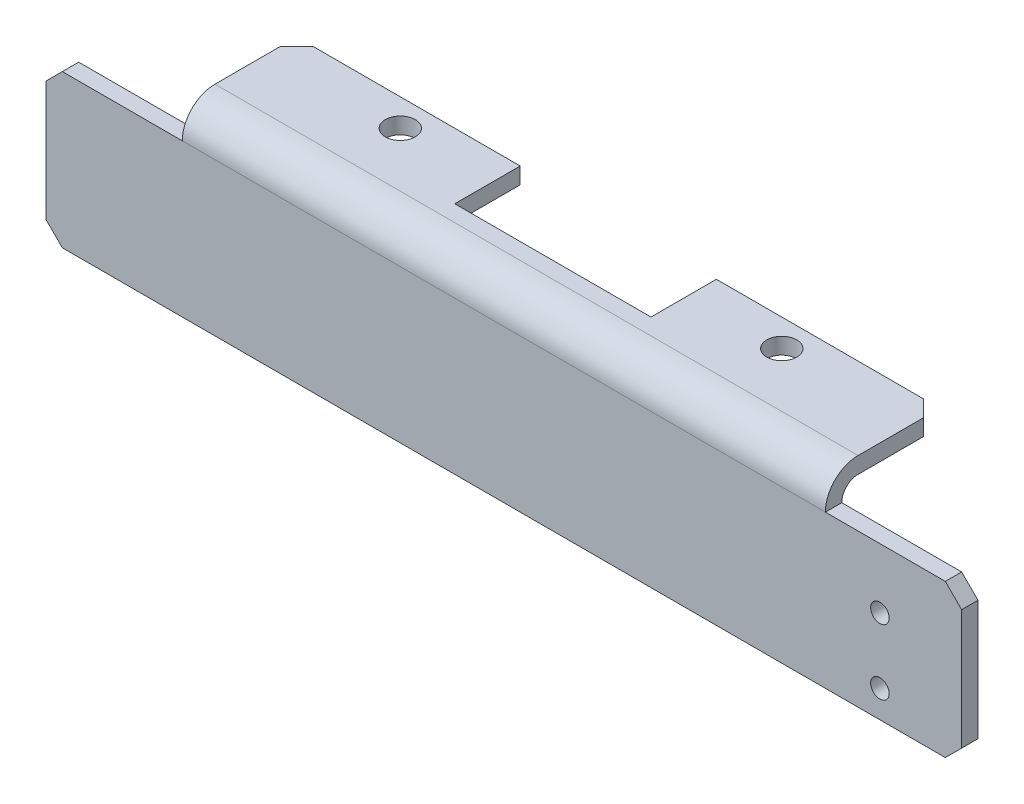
ISO-10303-21;
HEADER;
FILE_DESCRIPTION(('STEP AP214'),'2;1');
FILE_NAME('part.step','',(''),(''),'','','');
FILE_SCHEMA(('AUTOMOTIVE_DESIGN { 1 0 10303 214 1 1 1 1 }'));
ENDSEC;
DATA;
#1=APPLICATION_CONTEXT('core data for automotive mechanical design processes');
#2=APPLICATION_PROTOCOL_DEFINITION('international standard','automotive_design',2000,#1);
#3=PRODUCT_CONTEXT('',#1,'mechanical');
#4=PRODUCT('Part','Part','',(#3));
#5=PRODUCT_RELATED_PRODUCT_CATEGORY('part','',(#4));
#6=PRODUCT_DEFINITION_FORMATION('','',#4);
#7=PRODUCT_DEFINITION_CONTEXT('part definition',#1,'design');
#8=PRODUCT_DEFINITION('design','',#6,#7);
#9=PRODUCT_DEFINITION_SHAPE('','',#8);
#10=(LENGTH_UNIT() NAMED_UNIT(*) SI_UNIT(.MILLI.,.METRE.));
#11=(NAMED_UNIT(*) PLANE_ANGLE_UNIT() SI_UNIT($,.RADIAN.));
#12=(NAMED_UNIT(*) SI_UNIT($,.STERADIAN.) SOLID_ANGLE_UNIT());
#13=UNCERTAINTY_MEASURE_WITH_UNIT(LENGTH_MEASURE(1.E-05),#10,'distance_accuracy_value','');
#14=(GEOMETRIC_REPRESENTATION_CONTEXT(3) GLOBAL_UNCERTAINTY_ASSIGNED_CONTEXT((#13)) GLOBAL_UNIT_ASSIGNED_CONTEXT((#10,
#11,#12)) REPRESENTATION_CONTEXT('',''));
#15=CARTESIAN_POINT('',(0.,0.,0.));
#16=DIRECTION('',(0.,0.,1.));
#17=DIRECTION('',(1.,0.,0.));
#18=AXIS2_PLACEMENT_3D('',#15,#16,#17);
#19=CARTESIAN_POINT('',(168.,4.98148640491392,-17.6273582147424));
#20=DIRECTION('',(0.,0.,1.));
#21=DIRECTION('',(1.,0.,0.));
#22=AXIS2_PLACEMENT_3D('',#19,#20,#21);
#23=PLANE('',#22);
#24=DIRECTION('',(-1.,0.,0.));
#25=VECTOR('',#24,1.);
#26=CARTESIAN_POINT('',(168.,4.98148640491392,-17.6273582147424));
#27=LINE('',#26,#25);
#28=CARTESIAN_POINT('',(65.9999999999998,4.98148640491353,-17.6273582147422));
#29=VERTEX_POINT('',#28);
#30=CARTESIAN_POINT('',(28.,4.9814864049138,-17.6273582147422));
#31=VERTEX_POINT('',#30);
#32=EDGE_CURVE('E260',#29,#31,#27,.T.);
#33=ORIENTED_EDGE('',*,*,#32,.T.);
#34=DIRECTION('',(0.,1.,0.));
#35=VECTOR('',#34,1.);
#36=CARTESIAN_POINT('',(27.9999999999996,4.98148640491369,-17.6273582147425));
#37=LINE('',#36,#35);
#38=CARTESIAN_POINT('',(27.9999999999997,7.9814864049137,-17.627358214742));
#39=VERTEX_POINT('',#38);
#40=EDGE_CURVE('E314',#31,#39,#37,.T.);
#41=ORIENTED_EDGE('',*,*,#40,.T.);
#42=DIRECTION('',(-1.,0.,0.));
#43=VECTOR('',#42,1.);
#44=CARTESIAN_POINT('',(168.,7.98148640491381,-17.627358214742));
#45=LINE('',#44,#43);
#46=CARTESIAN_POINT('',(66.,7.9814864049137,-17.627358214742));
#47=VERTEX_POINT('',#46);
#48=EDGE_CURVE('E258',#47,#39,#45,.T.);
#49=ORIENTED_EDGE('',*,*,#48,.F.);
#50=DIRECTION('',(0.,1.,0.));
#51=VECTOR('',#50,1.);
#52=CARTESIAN_POINT('',(65.9999999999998,1.98148640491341,-17.6273582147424));
#53=LINE('',#52,#51);
#54=EDGE_CURVE('E202',#29,#47,#53,.T.);
#55=ORIENTED_EDGE('',*,*,#54,.F.);
#56=EDGE_LOOP('',(#33,#41,#49,#55));
#57=FACE_BOUND('',#56,.T.);
#58=ADVANCED_FACE('F36',(#57),#23,.F.);
#59=CARTESIAN_POINT('',(168.,-26.0185135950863,0.372641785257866));
#60=DIRECTION('',(0.,1.,0.));
#61=DIRECTION('',(0.,0.,1.));
#62=AXIS2_PLACEMENT_3D('',#59,#60,#61);
#63=PLANE('',#62);
#64=DIRECTION('',(-1.,0.,0.));
#65=VECTOR('',#64,1.);
#66=CARTESIAN_POINT('',(168.,-26.0185135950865,3.37264178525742));
#67=LINE('',#66,#65);
#68=CARTESIAN_POINT('',(165.,-26.0185135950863,3.3726417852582));
#69=VERTEX_POINT('',#68);
#70=CARTESIAN_POINT('',(3.0000000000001,-26.0185135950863,3.37264178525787));
#71=VERTEX_POINT('',#70);
#72=EDGE_CURVE('E245',#69,#71,#67,.T.);
#73=ORIENTED_EDGE('',*,*,#72,.T.);
#74=DIRECTION('',(0.,0.,-1.));
#75=VECTOR('',#74,1.);
#76=CARTESIAN_POINT('',(2.99999999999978,-26.0185135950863,0.372641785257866));
#77=LINE('',#76,#75);
#78=CARTESIAN_POINT('',(2.99999999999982,-26.0185135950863,0.372641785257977));
#79=VERTEX_POINT('',#78);
#80=EDGE_CURVE('E280',#71,#79,#77,.T.);
#81=ORIENTED_EDGE('',*,*,#80,.T.);
#82=DIRECTION('',(-1.,0.,0.));
#83=VECTOR('',#82,1.);
#84=CARTESIAN_POINT('',(168.,-26.0185135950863,0.372641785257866));
#85=LINE('',#84,#83);
#86=CARTESIAN_POINT('',(165.,-26.0185135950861,0.372641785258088));
#87=VERTEX_POINT('',#86);
#88=EDGE_CURVE('E269',#87,#79,#85,.T.);
#89=ORIENTED_EDGE('',*,*,#88,.F.);
#90=DIRECTION('',(0.,0.,1.));
#91=VECTOR('',#90,1.);
#92=CARTESIAN_POINT('',(165.,-26.0185135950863,3.3726417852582));
#93=LINE('',#92,#91);
#94=EDGE_CURVE('E278',#87,#69,#93,.T.);
#95=ORIENTED_EDGE('',*,*,#94,.T.);
#96=EDGE_LOOP('',(#73,#81,#89,#95));
#97=FACE_BOUND('',#96,.T.);
#98=ADVANCED_FACE('F417',(#97),#63,.F.);
#99=CARTESIAN_POINT('',(168.,1.9814864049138,0.372641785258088));
#100=DIRECTION('',(0.,0.,1.));
#101=DIRECTION('',(0.,-1.,0.));
#102=AXIS2_PLACEMENT_3D('',#99,#100,#101);
#103=PLANE('',#102);
#104=CARTESIAN_POINT('',(153.,-21.0185135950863,0.372641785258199));
#105=DIRECTION('',(0.,0.,1.));
#106=DIRECTION('',(0.,-1.,0.));
#107=AXIS2_PLACEMENT_3D('',#104,#105,#106);
#108=CIRCLE('',#107,1.70000000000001);
#109=CARTESIAN_POINT('',(153.,-22.7185135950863,0.372641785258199));
#110=VERTEX_POINT('',#109);
#111=EDGE_CURVE('E379',#110,#110,#108,.T.);
#112=ORIENTED_EDGE('',*,*,#111,.T.);
#113=EDGE_LOOP('',(#112));
#114=FACE_BOUND('',#113,.T.);
#115=CARTESIAN_POINT('',(153.,-9.01851359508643,0.372641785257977));
#116=DIRECTION('',(0.,0.,1.));
#117=DIRECTION('',(0.,-1.,0.));
#118=AXIS2_PLACEMENT_3D('',#115,#116,#117);
#119=CIRCLE('',#118,1.70000000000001);
#120=CARTESIAN_POINT('',(153.,-10.7185135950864,0.372641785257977));
#121=VERTEX_POINT('',#120);
#122=EDGE_CURVE('E384',#121,#121,#119,.T.);
#123=ORIENTED_EDGE('',*,*,#122,.T.);
#124=EDGE_LOOP('',(#123));
#125=FACE_BOUND('',#124,.T.);
#126=ORIENTED_EDGE('',*,*,#88,.T.);
#127=DIRECTION('',(0.707106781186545,-0.707106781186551,0.));
#128=VECTOR('',#127,1.);
#129=CARTESIAN_POINT('',(2.99999999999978,-26.0185135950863,0.372641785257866));
#130=LINE('',#129,#128);
#131=CARTESIAN_POINT('',(-1.11022302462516E-13,-23.0185135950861,0.372641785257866));
#132=VERTEX_POINT('',#131);
#133=EDGE_CURVE('E289',#79,#132,#130,.F.);
#134=ORIENTED_EDGE('',*,*,#133,.T.);
#135=DIRECTION('',(0.,1.,0.));
#136=VECTOR('',#135,1.);
#137=CARTESIAN_POINT('',(-4.44089209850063E-13,1.98148640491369,0.372641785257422));
#138=LINE('',#137,#136);
#139=CARTESIAN_POINT('',(0.,-1.01851359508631,0.372641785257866));
#140=VERTEX_POINT('',#139);
#141=EDGE_CURVE('E237',#132,#140,#138,.T.);
#142=ORIENTED_EDGE('',*,*,#141,.T.);
#143=DIRECTION('',(-0.707106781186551,-0.707106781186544,0.));
#144=VECTOR('',#143,1.);
#145=CARTESIAN_POINT('',(0.,-1.01851359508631,0.372641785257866));
#146=LINE('',#145,#144);
#147=CARTESIAN_POINT('',(2.99999999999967,1.98148640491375,0.372641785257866));
#148=VERTEX_POINT('',#147);
#149=EDGE_CURVE('E287',#140,#148,#146,.F.);
#150=ORIENTED_EDGE('',*,*,#149,.T.);
#151=DIRECTION('',(-1.,0.,0.));
#152=VECTOR('',#151,1.);
#153=CARTESIAN_POINT('',(168.,1.98148640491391,0.372641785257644));
#154=LINE('',#153,#152);
#155=CARTESIAN_POINT('',(25.,1.9814864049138,0.372641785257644));
#156=VERTEX_POINT('',#155);
#157=EDGE_CURVE('E215',#148,#156,#154,.F.);
#158=ORIENTED_EDGE('',*,*,#157,.T.);
#159=DIRECTION('',(-1.,0.,0.));
#160=VECTOR('',#159,1.);
#161=CARTESIAN_POINT('',(168.,1.9814864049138,0.372641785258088));
#162=LINE('',#161,#160);
#163=CARTESIAN_POINT('',(143.,1.98148640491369,0.372641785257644));
#164=VERTEX_POINT('',#163);
#165=EDGE_CURVE('E266',#164,#156,#162,.T.);
#166=ORIENTED_EDGE('',*,*,#165,.F.);
#167=CARTESIAN_POINT('',(165.,1.98148640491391,0.372641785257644));
#168=VERTEX_POINT('',#167);
#169=EDGE_CURVE('E267',#168,#164,#162,.T.);
#170=ORIENTED_EDGE('',*,*,#169,.F.);
#171=DIRECTION('',(0.707106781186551,-0.707106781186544,0.));
#172=VECTOR('',#171,1.);
#173=CARTESIAN_POINT('',(165.,1.98148640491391,0.372641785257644));
#174=LINE('',#173,#172);
#175=CARTESIAN_POINT('',(168.,-1.01851359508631,0.372641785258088));
#176=VERTEX_POINT('',#175);
#177=EDGE_CURVE('E285',#168,#176,#174,.T.);
#178=ORIENTED_EDGE('',*,*,#177,.T.);
#179=DIRECTION('',(0.,1.,0.));
#180=VECTOR('',#179,1.);
#181=CARTESIAN_POINT('',(168.,1.9814864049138,0.372641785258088));
#182=LINE('',#181,#180);
#183=CARTESIAN_POINT('',(168.,-23.0185135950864,0.372641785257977));
#184=VERTEX_POINT('',#183);
#185=EDGE_CURVE('E238',#184,#176,#182,.T.);
#186=ORIENTED_EDGE('',*,*,#185,.F.);
#187=DIRECTION('',(-0.707106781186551,-0.707106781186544,0.));
#188=VECTOR('',#187,1.);
#189=CARTESIAN_POINT('',(168.,-23.0185135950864,0.372641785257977));
#190=LINE('',#189,#188);
#191=EDGE_CURVE('E283',#184,#87,#190,.T.);
#192=ORIENTED_EDGE('',*,*,#191,.T.);
#193=EDGE_LOOP('',(#126,#134,#142,#150,#158,#166,#170,#178,#186,#192));
#194=FACE_BOUND('',#193,.T.);
#195=ADVANCED_FACE('F347',(#114,#125,#194),#103,.F.);
#196=CARTESIAN_POINT('',(168.,1.98148640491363,-2.62735821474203));
#197=DIRECTION('',(-1.,0.,0.));
#198=DIRECTION('',(0.,0.,1.));
#199=AXIS2_PLACEMENT_3D('',#196,#197,#198);
#200=CYLINDRICAL_SURFACE('',#199,3.);
#201=DIRECTION('',(-1.,0.,0.));
#202=VECTOR('',#201,1.);
#203=CARTESIAN_POINT('',(168.,4.98148640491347,-2.62735821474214));
#204=LINE('',#203,#202);
#205=CARTESIAN_POINT('',(143.,4.98148640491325,-2.62735821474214));
#206=VERTEX_POINT('',#205);
#207=CARTESIAN_POINT('',(25.,4.98148640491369,-2.62735821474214));
#208=VERTEX_POINT('',#207);
#209=EDGE_CURVE('E263',#206,#208,#204,.T.);
#210=ORIENTED_EDGE('',*,*,#209,.F.);
#211=CARTESIAN_POINT('',(143.,1.9814864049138,-2.62735821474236));
#212=DIRECTION('',(-1.,0.,0.));
#213=DIRECTION('',(0.,0.,1.));
#214=AXIS2_PLACEMENT_3D('',#211,#212,#213);
#215=CIRCLE('',#214,3.);
#216=EDGE_CURVE('E234',#206,#164,#215,.F.);
#217=ORIENTED_EDGE('',*,*,#216,.T.);
#218=ORIENTED_EDGE('',*,*,#165,.T.);
#219=CARTESIAN_POINT('',(24.9999999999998,1.98148640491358,-2.62735821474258));
#220=DIRECTION('',(1.,0.,0.));
#221=DIRECTION('',(0.,0.,-1.));
#222=AXIS2_PLACEMENT_3D('',#219,#220,#221);
#223=CIRCLE('',#222,3.);
#224=EDGE_CURVE('E229',#156,#208,#223,.F.);
#225=ORIENTED_EDGE('',*,*,#224,.T.);
#226=EDGE_LOOP('',(#210,#217,#218,#225));
#227=FACE_BOUND('',#226,.T.);
#228=ADVANCED_FACE('F354',(#227),#200,.F.);
#229=CARTESIAN_POINT('',(168.,4.98148640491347,-2.62735821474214));
#230=DIRECTION('',(0.,1.,0.));
#231=DIRECTION('',(0.,0.,1.));
#232=AXIS2_PLACEMENT_3D('',#229,#230,#231);
#233=PLANE('',#232);
#234=CARTESIAN_POINT('',(48.9999999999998,4.9814864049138,-12.6273582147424));
#235=DIRECTION('',(0.,1.,0.));
#236=DIRECTION('',(0.,0.,1.));
#237=AXIS2_PLACEMENT_3D('',#234,#235,#236);
#238=CIRCLE('',#237,2.75);
#239=CARTESIAN_POINT('',(48.9999999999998,4.9814864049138,-9.87735821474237));
#240=VERTEX_POINT('',#239);
#241=EDGE_CURVE('E368',#240,#240,#238,.T.);
#242=ORIENTED_EDGE('',*,*,#241,.T.);
#243=EDGE_LOOP('',(#242));
#244=FACE_BOUND('',#243,.T.);
#245=CARTESIAN_POINT('',(119.,4.98148640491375,-12.6273582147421));
#246=DIRECTION('',(0.,1.,0.));
#247=DIRECTION('',(0.,0.,1.));
#248=AXIS2_PLACEMENT_3D('',#245,#246,#247);
#249=CIRCLE('',#248,2.75000000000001);
#250=CARTESIAN_POINT('',(119.,4.98148640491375,-9.87735821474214));
#251=VERTEX_POINT('',#250);
#252=EDGE_CURVE('E370',#251,#251,#249,.T.);
#253=ORIENTED_EDGE('',*,*,#252,.T.);
#254=EDGE_LOOP('',(#253));
#255=FACE_BOUND('',#254,.T.);
#256=DIRECTION('',(0.,0.,-1.));
#257=VECTOR('',#256,1.);
#258=CARTESIAN_POINT('',(25.,4.98148640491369,-2.62735821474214));
#259=LINE('',#258,#257);
#260=CARTESIAN_POINT('',(24.9999999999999,4.98148640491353,-14.6273582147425));
#261=VERTEX_POINT('',#260);
#262=EDGE_CURVE('E226',#208,#261,#259,.T.);
#263=ORIENTED_EDGE('',*,*,#262,.T.);
#264=DIRECTION('',(-0.707106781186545,0.,0.707106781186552));
#265=VECTOR('',#264,1.);
#266=CARTESIAN_POINT('',(27.9999999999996,4.98148640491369,-17.6273582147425));
#267=LINE('',#266,#265);
#268=EDGE_CURVE('E324',#261,#31,#267,.F.);
#269=ORIENTED_EDGE('',*,*,#268,.T.);
#270=ORIENTED_EDGE('',*,*,#32,.F.);
#271=DIRECTION('',(0.,0.,1.));
#272=VECTOR('',#271,1.);
#273=CARTESIAN_POINT('',(65.9999999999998,4.98148640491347,-2.62735821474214));
#274=LINE('',#273,#272);
#275=CARTESIAN_POINT('',(65.9999999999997,4.98148640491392,-5.62735821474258));
#276=VERTEX_POINT('',#275);
#277=EDGE_CURVE('E208',#29,#276,#274,.T.);
#278=ORIENTED_EDGE('',*,*,#277,.T.);
#279=DIRECTION('',(1.,0.,0.));
#280=VECTOR('',#279,1.);
#281=CARTESIAN_POINT('',(168.,4.98148640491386,-5.62735821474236));
#282=LINE('',#281,#280);
#283=CARTESIAN_POINT('',(102.,4.98148640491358,-5.62735821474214));
#284=VERTEX_POINT('',#283);
#285=EDGE_CURVE('E204',#276,#284,#282,.T.);
#286=ORIENTED_EDGE('',*,*,#285,.T.);
#287=DIRECTION('',(0.,0.,-1.));
#288=VECTOR('',#287,1.);
#289=CARTESIAN_POINT('',(102.,4.98148640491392,-2.62735821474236));
#290=LINE('',#289,#288);
#291=CARTESIAN_POINT('',(102.,4.98148640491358,-17.6273582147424));
#292=VERTEX_POINT('',#291);
#293=EDGE_CURVE('E180',#284,#292,#290,.T.);
#294=ORIENTED_EDGE('',*,*,#293,.T.);
#295=CARTESIAN_POINT('',(140.,4.9814864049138,-17.6273582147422));
#296=VERTEX_POINT('',#295);
#297=EDGE_CURVE('E261',#296,#292,#27,.T.);
#298=ORIENTED_EDGE('',*,*,#297,.F.);
#299=DIRECTION('',(-0.707106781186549,0.,-0.707106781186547));
#300=VECTOR('',#299,1.);
#301=CARTESIAN_POINT('',(143.,4.9814864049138,-14.6273582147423));
#302=LINE('',#301,#300);
#303=CARTESIAN_POINT('',(143.,4.9814864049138,-14.6273582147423));
#304=VERTEX_POINT('',#303);
#305=EDGE_CURVE('E51',#296,#304,#302,.F.);
#306=ORIENTED_EDGE('',*,*,#305,.T.);
#307=DIRECTION('',(0.,0.,1.));
#308=VECTOR('',#307,1.);
#309=CARTESIAN_POINT('',(143.,4.98148640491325,-2.62735821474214));
#310=LINE('',#309,#308);
#311=EDGE_CURVE('E232',#304,#206,#310,.T.);
#312=ORIENTED_EDGE('',*,*,#311,.T.);
#313=ORIENTED_EDGE('',*,*,#209,.T.);
#314=EDGE_LOOP('',(#263,#269,#270,#278,#286,#294,#298,#306,#312,#313));
#315=FACE_BOUND('',#314,.T.);
#316=ADVANCED_FACE('F355',(#244,#255,#315),#233,.F.);
#317=CARTESIAN_POINT('',(140.,7.98148640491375,-17.627358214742));
#318=VERTEX_POINT('',#317);
#319=CARTESIAN_POINT('',(102.,7.98148640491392,-17.6273582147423));
#320=VERTEX_POINT('',#319);
#321=EDGE_CURVE('E197',#318,#320,#45,.T.);
#322=ORIENTED_EDGE('',*,*,#321,.F.);
#323=DIRECTION('',(0.,-1.,0.));
#324=VECTOR('',#323,1.);
#325=CARTESIAN_POINT('',(140.,4.9814864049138,-17.6273582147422));
#326=LINE('',#325,#324);
#327=EDGE_CURVE('E11',#318,#296,#326,.T.);
#328=ORIENTED_EDGE('',*,*,#327,.T.);
#329=ORIENTED_EDGE('',*,*,#297,.T.);
#330=DIRECTION('',(0.,1.,0.));
#331=VECTOR('',#330,1.);
#332=CARTESIAN_POINT('',(102.,1.98148640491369,-17.6273582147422));
#333=LINE('',#332,#331);
#334=EDGE_CURVE('E183',#292,#320,#333,.T.);
#335=ORIENTED_EDGE('',*,*,#334,.T.);
#336=EDGE_LOOP('',(#322,#328,#329,#335));
#337=FACE_BOUND('',#336,.T.);
#338=ADVANCED_FACE('F442',(#337),#23,.F.);
#339=CARTESIAN_POINT('',(168.,7.9814864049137,-2.62735821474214));
#340=DIRECTION('',(0.,-1.,0.));
#341=DIRECTION('',(0.,0.,-1.));
#342=AXIS2_PLACEMENT_3D('',#339,#340,#341);
#343=PLANE('',#342);
#344=CARTESIAN_POINT('',(49.,7.9814864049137,-12.6273582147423));
#345=DIRECTION('',(0.,1.,0.));
#346=DIRECTION('',(0.,0.,1.));
#347=AXIS2_PLACEMENT_3D('',#344,#345,#346);
#348=CIRCLE('',#347,2.75);
#349=CARTESIAN_POINT('',(49.,7.9814864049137,-9.87735821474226));
#350=VERTEX_POINT('',#349);
#351=EDGE_CURVE('E375',#350,#350,#348,.T.);
#352=ORIENTED_EDGE('',*,*,#351,.F.);
#353=EDGE_LOOP('',(#352));
#354=FACE_BOUND('',#353,.T.);
#355=CARTESIAN_POINT('',(119.,7.98148640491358,-12.6273582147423));
#356=DIRECTION('',(0.,1.,0.));
#357=DIRECTION('',(0.,0.,1.));
#358=AXIS2_PLACEMENT_3D('',#355,#356,#357);
#359=CIRCLE('',#358,2.75000000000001);
#360=CARTESIAN_POINT('',(119.,7.98148640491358,-9.87735821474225));
#361=VERTEX_POINT('',#360);
#362=EDGE_CURVE('E376',#361,#361,#359,.T.);
#363=ORIENTED_EDGE('',*,*,#362,.F.);
#364=EDGE_LOOP('',(#363));
#365=FACE_BOUND('',#364,.T.);
#366=ORIENTED_EDGE('',*,*,#48,.T.);
#367=DIRECTION('',(0.707106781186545,0.,-0.707106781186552));
#368=VECTOR('',#367,1.);
#369=CARTESIAN_POINT('',(27.9999999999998,7.98148640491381,-17.6273582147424));
#370=LINE('',#369,#368);
#371=CARTESIAN_POINT('',(25.,7.98148640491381,-14.6273582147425));
#372=VERTEX_POINT('',#371);
#373=EDGE_CURVE('E319',#39,#372,#370,.F.);
#374=ORIENTED_EDGE('',*,*,#373,.T.);
#375=DIRECTION('',(0.,0.,-1.));
#376=VECTOR('',#375,1.);
#377=CARTESIAN_POINT('',(24.9999999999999,7.9814864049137,-17.6273582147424));
#378=LINE('',#377,#376);
#379=CARTESIAN_POINT('',(25.,7.9814864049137,-2.62735821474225));
#380=VERTEX_POINT('',#379);
#381=EDGE_CURVE('E211',#380,#372,#378,.T.);
#382=ORIENTED_EDGE('',*,*,#381,.F.);
#383=DIRECTION('',(-1.,0.,0.));
#384=VECTOR('',#383,1.);
#385=CARTESIAN_POINT('',(168.,7.9814864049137,-2.62735821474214));
#386=LINE('',#385,#384);
#387=CARTESIAN_POINT('',(143.,7.98148640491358,-2.62735821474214));
#388=VERTEX_POINT('',#387);
#389=EDGE_CURVE('E255',#388,#380,#386,.T.);
#390=ORIENTED_EDGE('',*,*,#389,.F.);
#391=DIRECTION('',(0.,0.,1.));
#392=VECTOR('',#391,1.);
#393=CARTESIAN_POINT('',(143.,7.98148640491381,3.37264178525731));
#394=LINE('',#393,#392);
#395=CARTESIAN_POINT('',(143.,7.9814864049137,-14.6273582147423));
#396=VERTEX_POINT('',#395);
#397=EDGE_CURVE('E216',#396,#388,#394,.T.);
#398=ORIENTED_EDGE('',*,*,#397,.F.);
#399=DIRECTION('',(0.707106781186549,0.,0.707106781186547));
#400=VECTOR('',#399,1.);
#401=CARTESIAN_POINT('',(143.,7.9814864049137,-14.6273582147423));
#402=LINE('',#401,#400);
#403=EDGE_CURVE('E317',#396,#318,#402,.F.);
#404=ORIENTED_EDGE('',*,*,#403,.T.);
#405=ORIENTED_EDGE('',*,*,#321,.T.);
#406=DIRECTION('',(0.,0.,-1.));
#407=VECTOR('',#406,1.);
#408=CARTESIAN_POINT('',(102.,7.98148640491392,-17.6273582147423));
#409=LINE('',#408,#407);
#410=CARTESIAN_POINT('',(102.,7.98148640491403,-5.62735821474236));
#411=VERTEX_POINT('',#410);
#412=EDGE_CURVE('E177',#411,#320,#409,.T.);
#413=ORIENTED_EDGE('',*,*,#412,.F.);
#414=DIRECTION('',(1.,0.,0.));
#415=VECTOR('',#414,1.);
#416=CARTESIAN_POINT('',(102.,7.98148640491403,-5.62735821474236));
#417=LINE('',#416,#415);
#418=CARTESIAN_POINT('',(65.9999999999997,7.9814864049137,-5.62735821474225));
#419=VERTEX_POINT('',#418);
#420=EDGE_CURVE('E188',#419,#411,#417,.T.);
#421=ORIENTED_EDGE('',*,*,#420,.F.);
#422=DIRECTION('',(0.,0.,1.));
#423=VECTOR('',#422,1.);
#424=CARTESIAN_POINT('',(65.9999999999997,7.9814864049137,-5.62735821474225));
#425=LINE('',#424,#423);
#426=EDGE_CURVE('E193',#47,#419,#425,.T.);
#427=ORIENTED_EDGE('',*,*,#426,.F.);
#428=EDGE_LOOP('',(#366,#374,#382,#390,#398,#404,#405,#413,#421,#427));
#429=FACE_BOUND('',#428,.T.);
#430=ADVANCED_FACE('F196',(#354,#365,#429),#343,.F.);
#431=CARTESIAN_POINT('',(168.,1.98148640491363,-2.62735821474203));
#432=DIRECTION('',(-1.,0.,0.));
#433=DIRECTION('',(0.,0.,1.));
#434=AXIS2_PLACEMENT_3D('',#431,#432,#433);
#435=CYLINDRICAL_SURFACE('',#434,6.);
#436=DIRECTION('',(-1.,0.,0.));
#437=VECTOR('',#436,1.);
#438=CARTESIAN_POINT('',(168.,1.98148640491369,3.37264178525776));
#439=LINE('',#438,#437);
#440=CARTESIAN_POINT('',(143.,1.98148640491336,3.37264178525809));
#441=VERTEX_POINT('',#440);
#442=CARTESIAN_POINT('',(25.,1.98148640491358,3.37264178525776));
#443=VERTEX_POINT('',#442);
#444=EDGE_CURVE('E252',#441,#443,#439,.T.);
#445=ORIENTED_EDGE('',*,*,#444,.F.);
#446=CARTESIAN_POINT('',(143.,1.9814864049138,-2.62735821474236));
#447=DIRECTION('',(-1.,0.,0.));
#448=DIRECTION('',(0.,0.,1.));
#449=AXIS2_PLACEMENT_3D('',#446,#447,#448);
#450=CIRCLE('',#449,6.);
#451=EDGE_CURVE('E275',#441,#388,#450,.T.);
#452=ORIENTED_EDGE('',*,*,#451,.T.);
#453=ORIENTED_EDGE('',*,*,#389,.T.);
#454=CARTESIAN_POINT('',(24.9999999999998,1.98148640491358,-2.62735821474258));
#455=DIRECTION('',(1.,0.,0.));
#456=DIRECTION('',(0.,0.,-1.));
#457=AXIS2_PLACEMENT_3D('',#454,#455,#456);
#458=CIRCLE('',#457,6.);
#459=EDGE_CURVE('E272',#380,#443,#458,.T.);
#460=ORIENTED_EDGE('',*,*,#459,.T.);
#461=EDGE_LOOP('',(#445,#452,#453,#460));
#462=FACE_BOUND('',#461,.T.);
#463=ADVANCED_FACE('F337',(#462),#435,.T.);
#464=CARTESIAN_POINT('',(168.,1.98148640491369,3.37264178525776));
#465=DIRECTION('',(0.,0.,-1.));
#466=DIRECTION('',(0.,1.,0.));
#467=AXIS2_PLACEMENT_3D('',#464,#465,#466);
#468=PLANE('',#467);
#469=CARTESIAN_POINT('',(153.,-21.0185135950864,3.37264178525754));
#470=DIRECTION('',(0.,0.,1.));
#471=DIRECTION('',(1.,0.,0.));
#472=AXIS2_PLACEMENT_3D('',#469,#470,#471);
#473=CIRCLE('',#472,1.70000000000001);
#474=CARTESIAN_POINT('',(154.7,-21.0185135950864,3.37264178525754));
#475=VERTEX_POINT('',#474);
#476=EDGE_CURVE('E387',#475,#475,#473,.T.);
#477=ORIENTED_EDGE('',*,*,#476,.F.);
#478=EDGE_LOOP('',(#477));
#479=FACE_BOUND('',#478,.T.);
#480=CARTESIAN_POINT('',(153.,-9.01851359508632,3.37264178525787));
#481=DIRECTION('',(0.,0.,1.));
#482=DIRECTION('',(1.,0.,0.));
#483=AXIS2_PLACEMENT_3D('',#480,#481,#482);
#484=CIRCLE('',#483,1.70000000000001);
#485=CARTESIAN_POINT('',(154.7,-9.01851359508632,3.37264178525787));
#486=VERTEX_POINT('',#485);
#487=EDGE_CURVE('E388',#486,#486,#484,.T.);
#488=ORIENTED_EDGE('',*,*,#487,.F.);
#489=EDGE_LOOP('',(#488));
#490=FACE_BOUND('',#489,.T.);
#491=DIRECTION('',(0.,-1.,0.));
#492=VECTOR('',#491,1.);
#493=CARTESIAN_POINT('',(0.,1.98148640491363,3.37264178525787));
#494=LINE('',#493,#492);
#495=CARTESIAN_POINT('',(0.,-1.01851359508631,3.37264178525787));
#496=VERTEX_POINT('',#495);
#497=CARTESIAN_POINT('',(-1.38777878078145E-13,-23.0185135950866,3.37264178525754));
#498=VERTEX_POINT('',#497);
#499=EDGE_CURVE('E242',#496,#498,#494,.T.);
#500=ORIENTED_EDGE('',*,*,#499,.T.);
#501=DIRECTION('',(-0.707106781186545,0.707106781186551,0.));
#502=VECTOR('',#501,1.);
#503=CARTESIAN_POINT('',(2.9999999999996,-26.0185135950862,3.37264178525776));
#504=LINE('',#503,#502);
#505=EDGE_CURVE('E302',#498,#71,#504,.F.);
#506=ORIENTED_EDGE('',*,*,#505,.T.);
#507=ORIENTED_EDGE('',*,*,#72,.F.);
#508=DIRECTION('',(0.707106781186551,0.707106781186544,0.));
#509=VECTOR('',#508,1.);
#510=CARTESIAN_POINT('',(168.,-23.0185135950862,3.37264178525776));
#511=LINE('',#510,#509);
#512=CARTESIAN_POINT('',(168.,-23.0185135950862,3.37264178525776));
#513=VERTEX_POINT('',#512);
#514=EDGE_CURVE('E296',#69,#513,#511,.T.);
#515=ORIENTED_EDGE('',*,*,#514,.T.);
#516=DIRECTION('',(0.,-1.,0.));
#517=VECTOR('',#516,1.);
#518=CARTESIAN_POINT('',(168.,1.98148640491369,3.37264178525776));
#519=LINE('',#518,#517);
#520=CARTESIAN_POINT('',(168.,-1.01851359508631,3.37264178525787));
#521=VERTEX_POINT('',#520);
#522=EDGE_CURVE('E241',#521,#513,#519,.T.);
#523=ORIENTED_EDGE('',*,*,#522,.F.);
#524=DIRECTION('',(-0.707106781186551,0.707106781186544,0.));
#525=VECTOR('',#524,1.);
#526=CARTESIAN_POINT('',(165.,1.9814864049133,3.37264178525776));
#527=LINE('',#526,#525);
#528=CARTESIAN_POINT('',(165.,1.9814864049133,3.37264178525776));
#529=VERTEX_POINT('',#528);
#530=EDGE_CURVE('E298',#521,#529,#527,.T.);
#531=ORIENTED_EDGE('',*,*,#530,.T.);
#532=EDGE_CURVE('E253',#529,#441,#439,.T.);
#533=ORIENTED_EDGE('',*,*,#532,.T.);
#534=ORIENTED_EDGE('',*,*,#444,.T.);
#535=DIRECTION('',(1.,0.,0.));
#536=VECTOR('',#535,1.);
#537=CARTESIAN_POINT('',(25.,1.98148640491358,3.37264178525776));
#538=LINE('',#537,#536);
#539=CARTESIAN_POINT('',(2.99999999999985,1.9814864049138,3.37264178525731));
#540=VERTEX_POINT('',#539);
#541=EDGE_CURVE('E219',#540,#443,#538,.T.);
#542=ORIENTED_EDGE('',*,*,#541,.F.);
#543=DIRECTION('',(0.707106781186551,0.707106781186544,0.));
#544=VECTOR('',#543,1.);
#545=CARTESIAN_POINT('',(0.,-1.01851359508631,3.37264178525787));
#546=LINE('',#545,#544);
#547=EDGE_CURVE('E300',#540,#496,#546,.F.);
#548=ORIENTED_EDGE('',*,*,#547,.T.);
#549=EDGE_LOOP('',(#500,#506,#507,#515,#523,#531,#533,#534,#542,#548));
#550=FACE_BOUND('',#549,.T.);
#551=ADVANCED_FACE('F397',(#479,#490,#550),#468,.F.);
#552=CARTESIAN_POINT('',(168.,1.98148640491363,-2.62735821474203));
#553=DIRECTION('',(1.,0.,0.));
#554=DIRECTION('',(0.,0.,-1.));
#555=AXIS2_PLACEMENT_3D('',#552,#553,#554);
#556=PLANE('',#555);
#557=ORIENTED_EDGE('',*,*,#185,.T.);
#558=DIRECTION('',(0.,0.,1.));
#559=VECTOR('',#558,1.);
#560=CARTESIAN_POINT('',(168.,-1.01851359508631,3.37264178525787));
#561=LINE('',#560,#559);
#562=EDGE_CURVE('E312',#176,#521,#561,.T.);
#563=ORIENTED_EDGE('',*,*,#562,.T.);
#564=ORIENTED_EDGE('',*,*,#522,.T.);
#565=DIRECTION('',(0.,0.,-1.));
#566=VECTOR('',#565,1.);
#567=CARTESIAN_POINT('',(168.,-23.0185135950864,0.372641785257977));
#568=LINE('',#567,#566);
#569=EDGE_CURVE('E309',#513,#184,#568,.T.);
#570=ORIENTED_EDGE('',*,*,#569,.T.);
#571=EDGE_LOOP('',(#557,#563,#564,#570));
#572=FACE_BOUND('',#571,.T.);
#573=ADVANCED_FACE('F400',(#572),#556,.T.);
#574=CARTESIAN_POINT('',(-1.38777878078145E-13,1.98148640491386,-2.62735821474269));
#575=DIRECTION('',(1.,0.,0.));
#576=DIRECTION('',(0.,0.,-1.));
#577=AXIS2_PLACEMENT_3D('',#574,#575,#576);
#578=PLANE('',#577);
#579=ORIENTED_EDGE('',*,*,#141,.F.);
#580=DIRECTION('',(0.,0.,1.));
#581=VECTOR('',#580,1.);
#582=CARTESIAN_POINT('',(0.,-23.0185135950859,-2.62735821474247));
#583=LINE('',#582,#581);
#584=EDGE_CURVE('E294',#132,#498,#583,.T.);
#585=ORIENTED_EDGE('',*,*,#584,.T.);
#586=ORIENTED_EDGE('',*,*,#499,.F.);
#587=DIRECTION('',(0.,0.,-1.));
#588=VECTOR('',#587,1.);
#589=CARTESIAN_POINT('',(-1.2490009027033E-13,-1.01851359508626,-2.62735821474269));
#590=LINE('',#589,#588);
#591=EDGE_CURVE('E291',#496,#140,#590,.T.);
#592=ORIENTED_EDGE('',*,*,#591,.T.);
#593=EDGE_LOOP('',(#579,#585,#586,#592));
#594=FACE_BOUND('',#593,.T.);
#595=ADVANCED_FACE('F557',(#594),#578,.F.);
#596=CARTESIAN_POINT('',(25.,1.9814864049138,-17.6273582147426));
#597=DIRECTION('',(1.,0.,0.));
#598=DIRECTION('',(0.,0.,-1.));
#599=AXIS2_PLACEMENT_3D('',#596,#597,#598);
#600=PLANE('',#599);
#601=ORIENTED_EDGE('',*,*,#381,.T.);
#602=DIRECTION('',(0.,-1.,0.));
#603=VECTOR('',#602,1.);
#604=CARTESIAN_POINT('',(25.,1.98148640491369,-14.6273582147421));
#605=LINE('',#604,#603);
#606=EDGE_CURVE('E321',#372,#261,#605,.T.);
#607=ORIENTED_EDGE('',*,*,#606,.T.);
#608=ORIENTED_EDGE('',*,*,#262,.F.);
#609=ORIENTED_EDGE('',*,*,#224,.F.);
#610=DIRECTION('',(0.,0.,-1.));
#611=VECTOR('',#610,1.);
#612=CARTESIAN_POINT('',(25.,1.9814864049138,-17.6273582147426));
#613=LINE('',#612,#611);
#614=EDGE_CURVE('E218',#443,#156,#613,.T.);
#615=ORIENTED_EDGE('',*,*,#614,.F.);
#616=ORIENTED_EDGE('',*,*,#459,.F.);
#617=EDGE_LOOP('',(#601,#607,#608,#609,#615,#616));
#618=FACE_BOUND('',#617,.T.);
#619=ADVANCED_FACE('F549',(#618),#600,.F.);
#620=CARTESIAN_POINT('',(0.,1.9814864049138,-1.11022302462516E-13));
#621=DIRECTION('',(0.,-1.,0.));
#622=DIRECTION('',(0.,0.,-1.));
#623=AXIS2_PLACEMENT_3D('',#620,#621,#622);
#624=PLANE('',#623);
#625=ORIENTED_EDGE('',*,*,#157,.F.);
#626=DIRECTION('',(0.,0.,1.));
#627=VECTOR('',#626,1.);
#628=CARTESIAN_POINT('',(2.99999999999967,1.9814864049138,-2.22044604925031E-13));
#629=LINE('',#628,#627);
#630=EDGE_CURVE('E304',#148,#540,#629,.T.);
#631=ORIENTED_EDGE('',*,*,#630,.T.);
#632=ORIENTED_EDGE('',*,*,#541,.T.);
#633=ORIENTED_EDGE('',*,*,#614,.T.);
#634=EDGE_LOOP('',(#625,#631,#632,#633));
#635=FACE_BOUND('',#634,.T.);
#636=ADVANCED_FACE('F542',(#635),#624,.F.);
#637=CARTESIAN_POINT('',(143.,1.98148640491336,3.37264178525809));
#638=DIRECTION('',(-1.,0.,0.));
#639=DIRECTION('',(0.,0.,1.));
#640=AXIS2_PLACEMENT_3D('',#637,#638,#639);
#641=PLANE('',#640);
#642=ORIENTED_EDGE('',*,*,#311,.F.);
#643=DIRECTION('',(0.,1.,0.));
#644=VECTOR('',#643,1.);
#645=CARTESIAN_POINT('',(143.,1.98148640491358,-14.6273582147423));
#646=LINE('',#645,#644);
#647=EDGE_CURVE('E44',#304,#396,#646,.T.);
#648=ORIENTED_EDGE('',*,*,#647,.T.);
#649=ORIENTED_EDGE('',*,*,#397,.T.);
#650=ORIENTED_EDGE('',*,*,#451,.F.);
#651=DIRECTION('',(0.,0.,1.));
#652=VECTOR('',#651,1.);
#653=CARTESIAN_POINT('',(143.,1.98148640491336,3.37264178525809));
#654=LINE('',#653,#652);
#655=EDGE_CURVE('E212',#164,#441,#654,.T.);
#656=ORIENTED_EDGE('',*,*,#655,.F.);
#657=ORIENTED_EDGE('',*,*,#216,.F.);
#658=EDGE_LOOP('',(#642,#648,#649,#650,#656,#657));
#659=FACE_BOUND('',#658,.T.);
#660=ADVANCED_FACE('F329',(#659),#641,.F.);
#661=CARTESIAN_POINT('',(0.,1.9814864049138,-1.11022302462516E-13));
#662=DIRECTION('',(0.,-1.,0.));
#663=DIRECTION('',(0.,0.,-1.));
#664=AXIS2_PLACEMENT_3D('',#661,#662,#663);
#665=PLANE('',#664);
#666=ORIENTED_EDGE('',*,*,#532,.F.);
#667=DIRECTION('',(0.,0.,-1.));
#668=VECTOR('',#667,1.);
#669=CARTESIAN_POINT('',(165.,1.98148640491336,0.372641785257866));
#670=LINE('',#669,#668);
#671=EDGE_CURVE('E306',#529,#168,#670,.T.);
#672=ORIENTED_EDGE('',*,*,#671,.T.);
#673=ORIENTED_EDGE('',*,*,#169,.T.);
#674=ORIENTED_EDGE('',*,*,#655,.T.);
#675=EDGE_LOOP('',(#666,#672,#673,#674));
#676=FACE_BOUND('',#675,.T.);
#677=ADVANCED_FACE('F342',(#676),#665,.F.);
#678=CARTESIAN_POINT('',(65.9999999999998,1.98148640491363,-5.62735821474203));
#679=DIRECTION('',(-1.,0.,0.));
#680=DIRECTION('',(0.,0.,1.));
#681=AXIS2_PLACEMENT_3D('',#678,#679,#680);
#682=PLANE('',#681);
#683=ORIENTED_EDGE('',*,*,#54,.T.);
#684=ORIENTED_EDGE('',*,*,#426,.T.);
#685=DIRECTION('',(0.,1.,0.));
#686=VECTOR('',#685,1.);
#687=CARTESIAN_POINT('',(65.9999999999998,1.98148640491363,-5.62735821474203));
#688=LINE('',#687,#686);
#689=EDGE_CURVE('E184',#276,#419,#688,.T.);
#690=ORIENTED_EDGE('',*,*,#689,.F.);
#691=ORIENTED_EDGE('',*,*,#277,.F.);
#692=EDGE_LOOP('',(#683,#684,#690,#691));
#693=FACE_BOUND('',#692,.T.);
#694=ADVANCED_FACE('F521',(#693),#682,.F.);
#695=CARTESIAN_POINT('',(102.,1.98148640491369,-17.6273582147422));
#696=DIRECTION('',(1.,0.,0.));
#697=DIRECTION('',(0.,0.,-1.));
#698=AXIS2_PLACEMENT_3D('',#695,#696,#697);
#699=PLANE('',#698);
#700=DIRECTION('',(0.,1.,0.));
#701=VECTOR('',#700,1.);
#702=CARTESIAN_POINT('',(102.,1.98148640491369,-5.62735821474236));
#703=LINE('',#702,#701);
#704=EDGE_CURVE('E172',#284,#411,#703,.T.);
#705=ORIENTED_EDGE('',*,*,#704,.T.);
#706=ORIENTED_EDGE('',*,*,#412,.T.);
#707=ORIENTED_EDGE('',*,*,#334,.F.);
#708=ORIENTED_EDGE('',*,*,#293,.F.);
#709=EDGE_LOOP('',(#705,#706,#707,#708));
#710=FACE_BOUND('',#709,.T.);
#711=ADVANCED_FACE('F174',(#710),#699,.F.);
#712=CARTESIAN_POINT('',(102.,1.98148640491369,-5.62735821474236));
#713=DIRECTION('',(0.,0.,1.));
#714=DIRECTION('',(1.,0.,0.));
#715=AXIS2_PLACEMENT_3D('',#712,#713,#714);
#716=PLANE('',#715);
#717=ORIENTED_EDGE('',*,*,#689,.T.);
#718=ORIENTED_EDGE('',*,*,#420,.T.);
#719=ORIENTED_EDGE('',*,*,#704,.F.);
#720=ORIENTED_EDGE('',*,*,#285,.F.);
#721=EDGE_LOOP('',(#717,#718,#719,#720));
#722=FACE_BOUND('',#721,.T.);
#723=ADVANCED_FACE('F189',(#722),#716,.F.);
#724=CARTESIAN_POINT('',(119.,1.98148640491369,-12.6273582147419));
#725=DIRECTION('',(0.,1.,0.));
#726=DIRECTION('',(0.,0.,1.));
#727=AXIS2_PLACEMENT_3D('',#724,#725,#726);
#728=CYLINDRICAL_SURFACE('',#727,2.75000000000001);
#729=ORIENTED_EDGE('',*,*,#362,.T.);
#730=EDGE_LOOP('',(#729));
#731=FACE_BOUND('',#730,.T.);
#732=ORIENTED_EDGE('',*,*,#252,.F.);
#733=EDGE_LOOP('',(#732));
#734=FACE_BOUND('',#733,.T.);
#735=ADVANCED_FACE('F500',(#731,#734),#728,.F.);
#736=CARTESIAN_POINT('',(48.9999999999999,1.9814864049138,-12.627358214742));
#737=DIRECTION('',(0.,1.,0.));
#738=DIRECTION('',(0.,0.,1.));
#739=AXIS2_PLACEMENT_3D('',#736,#737,#738);
#740=CYLINDRICAL_SURFACE('',#739,2.75);
#741=ORIENTED_EDGE('',*,*,#351,.T.);
#742=EDGE_LOOP('',(#741));
#743=FACE_BOUND('',#742,.T.);
#744=ORIENTED_EDGE('',*,*,#241,.F.);
#745=EDGE_LOOP('',(#744));
#746=FACE_BOUND('',#745,.T.);
#747=ADVANCED_FACE('F492',(#743,#746),#740,.F.);
#748=CARTESIAN_POINT('',(153.,-9.01851359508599,-2.62735821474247));
#749=DIRECTION('',(0.,0.,1.));
#750=DIRECTION('',(1.,0.,0.));
#751=AXIS2_PLACEMENT_3D('',#748,#749,#750);
#752=CYLINDRICAL_SURFACE('',#751,1.70000000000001);
#753=ORIENTED_EDGE('',*,*,#487,.T.);
#754=EDGE_LOOP('',(#753));
#755=FACE_BOUND('',#754,.T.);
#756=ORIENTED_EDGE('',*,*,#122,.F.);
#757=EDGE_LOOP('',(#756));
#758=FACE_BOUND('',#757,.T.);
#759=ADVANCED_FACE('F485',(#755,#758),#752,.F.);
#760=CARTESIAN_POINT('',(153.,-21.0185135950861,-2.62735821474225));
#761=DIRECTION('',(0.,0.,1.));
#762=DIRECTION('',(1.,0.,0.));
#763=AXIS2_PLACEMENT_3D('',#760,#761,#762);
#764=CYLINDRICAL_SURFACE('',#763,1.70000000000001);
#765=ORIENTED_EDGE('',*,*,#476,.T.);
#766=EDGE_LOOP('',(#765));
#767=FACE_BOUND('',#766,.T.);
#768=ORIENTED_EDGE('',*,*,#111,.F.);
#769=EDGE_LOOP('',(#768));
#770=FACE_BOUND('',#769,.T.);
#771=ADVANCED_FACE('F394',(#767,#770),#764,.F.);
#772=CARTESIAN_POINT('',(2.99999999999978,-26.0185135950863,0.372641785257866));
#773=DIRECTION('',(0.707106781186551,0.707106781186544,0.));
#774=DIRECTION('',(0.,0.,-1.));
#775=AXIS2_PLACEMENT_3D('',#772,#773,#774);
#776=PLANE('',#775);
#777=ORIENTED_EDGE('',*,*,#505,.F.);
#778=ORIENTED_EDGE('',*,*,#584,.F.);
#779=ORIENTED_EDGE('',*,*,#133,.F.);
#780=ORIENTED_EDGE('',*,*,#80,.F.);
#781=EDGE_LOOP('',(#777,#778,#779,#780));
#782=FACE_BOUND('',#781,.T.);
#783=ADVANCED_FACE('F414',(#782),#776,.F.);
#784=CARTESIAN_POINT('',(-1.2490009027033E-13,-1.01851359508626,-2.62735821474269));
#785=DIRECTION('',(0.707106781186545,-0.707106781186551,0.));
#786=DIRECTION('',(0.,0.,-1.));
#787=AXIS2_PLACEMENT_3D('',#784,#785,#786);
#788=PLANE('',#787);
#789=ORIENTED_EDGE('',*,*,#547,.F.);
#790=ORIENTED_EDGE('',*,*,#630,.F.);
#791=ORIENTED_EDGE('',*,*,#149,.F.);
#792=ORIENTED_EDGE('',*,*,#591,.F.);
#793=EDGE_LOOP('',(#789,#790,#791,#792));
#794=FACE_BOUND('',#793,.T.);
#795=ADVANCED_FACE('F431',(#794),#788,.F.);
#796=CARTESIAN_POINT('',(165.,1.98148640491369,2.22044604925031E-13));
#797=DIRECTION('',(0.707106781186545,0.707106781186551,0.));
#798=DIRECTION('',(0.,0.,1.));
#799=AXIS2_PLACEMENT_3D('',#796,#797,#798);
#800=PLANE('',#799);
#801=ORIENTED_EDGE('',*,*,#530,.F.);
#802=ORIENTED_EDGE('',*,*,#562,.F.);
#803=ORIENTED_EDGE('',*,*,#177,.F.);
#804=ORIENTED_EDGE('',*,*,#671,.F.);
#805=EDGE_LOOP('',(#801,#802,#803,#804));
#806=FACE_BOUND('',#805,.T.);
#807=ADVANCED_FACE('F429',(#806),#800,.T.);
#808=CARTESIAN_POINT('',(168.,-23.0185135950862,-2.62735821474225));
#809=DIRECTION('',(0.707106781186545,-0.707106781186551,0.));
#810=DIRECTION('',(0.,0.,1.));
#811=AXIS2_PLACEMENT_3D('',#808,#809,#810);
#812=PLANE('',#811);
#813=ORIENTED_EDGE('',*,*,#514,.F.);
#814=ORIENTED_EDGE('',*,*,#94,.F.);
#815=ORIENTED_EDGE('',*,*,#191,.F.);
#816=ORIENTED_EDGE('',*,*,#569,.F.);
#817=EDGE_LOOP('',(#813,#814,#815,#816));
#818=FACE_BOUND('',#817,.T.);
#819=ADVANCED_FACE('F423',(#818),#812,.T.);
#820=CARTESIAN_POINT('',(27.9999999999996,4.98148640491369,-17.6273582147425));
#821=DIRECTION('',(0.707106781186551,0.,0.707106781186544));
#822=DIRECTION('',(0.,1.,0.));
#823=AXIS2_PLACEMENT_3D('',#820,#821,#822);
#824=PLANE('',#823);
#825=ORIENTED_EDGE('',*,*,#268,.F.);
#826=ORIENTED_EDGE('',*,*,#606,.F.);
#827=ORIENTED_EDGE('',*,*,#373,.F.);
#828=ORIENTED_EDGE('',*,*,#40,.F.);
#829=EDGE_LOOP('',(#825,#826,#827,#828));
#830=FACE_BOUND('',#829,.T.);
#831=ADVANCED_FACE('F363',(#830),#824,.F.);
#832=CARTESIAN_POINT('',(143.,1.98148640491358,-14.6273582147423));
#833=DIRECTION('',(-0.707106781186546,0.,0.707106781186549));
#834=DIRECTION('',(0.,1.,0.));
#835=AXIS2_PLACEMENT_3D('',#832,#833,#834);
#836=PLANE('',#835);
#837=ORIENTED_EDGE('',*,*,#305,.F.);
#838=ORIENTED_EDGE('',*,*,#327,.F.);
#839=ORIENTED_EDGE('',*,*,#403,.F.);
#840=ORIENTED_EDGE('',*,*,#647,.F.);
#841=EDGE_LOOP('',(#837,#838,#839,#840));
#842=FACE_BOUND('',#841,.T.);
#843=ADVANCED_FACE('F38',(#842),#836,.F.);
#844=CLOSED_SHELL('',(#58,#98,#195,#228,#316,#338,#430,#463,#551,#573,#595,#619,#636,#660,#677,
#694,#711,#723,#735,#747,#759,#771,#783,#795,#807,#819,#831,#843));
#845=MANIFOLD_SOLID_BREP('B2',#844);
#846=ADVANCED_BREP_SHAPE_REPRESENTATION('',(#18,#845),#14);
#847=SHAPE_DEFINITION_REPRESENTATION(#9,#846);
ENDSEC;
END-ISO-10303-21;
